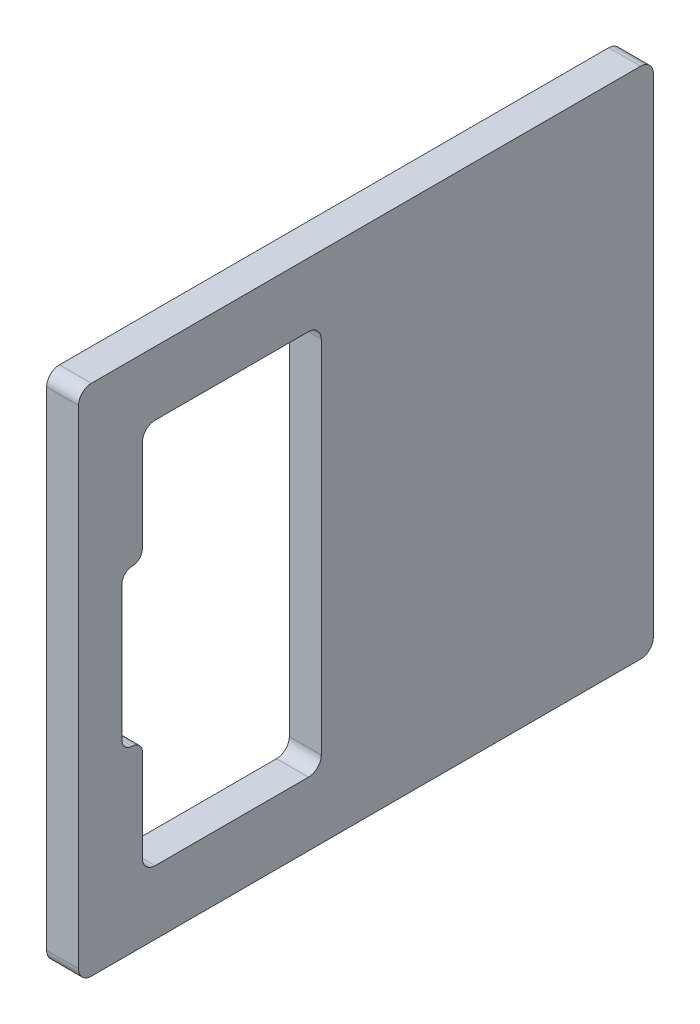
ISO-10303-21;
HEADER;
FILE_DESCRIPTION(('STEP AP214'),'2;1');
FILE_NAME('part.step','',(''),(''),'','','');
FILE_SCHEMA(('AUTOMOTIVE_DESIGN { 1 0 10303 214 1 1 1 1 }'));
ENDSEC;
DATA;
#1=APPLICATION_CONTEXT('core data for automotive mechanical design processes');
#2=APPLICATION_PROTOCOL_DEFINITION('international standard','automotive_design',2000,#1);
#3=PRODUCT_CONTEXT('',#1,'mechanical');
#4=PRODUCT('Part','Part','',(#3));
#5=PRODUCT_RELATED_PRODUCT_CATEGORY('part','',(#4));
#6=PRODUCT_DEFINITION_FORMATION('','',#4);
#7=PRODUCT_DEFINITION_CONTEXT('part definition',#1,'design');
#8=PRODUCT_DEFINITION('design','',#6,#7);
#9=PRODUCT_DEFINITION_SHAPE('','',#8);
#10=(LENGTH_UNIT() NAMED_UNIT(*) SI_UNIT(.MILLI.,.METRE.));
#11=(NAMED_UNIT(*) PLANE_ANGLE_UNIT() SI_UNIT($,.RADIAN.));
#12=(NAMED_UNIT(*) SI_UNIT($,.STERADIAN.) SOLID_ANGLE_UNIT());
#13=UNCERTAINTY_MEASURE_WITH_UNIT(LENGTH_MEASURE(1.E-05),#10,'distance_accuracy_value','');
#14=(GEOMETRIC_REPRESENTATION_CONTEXT(3) GLOBAL_UNCERTAINTY_ASSIGNED_CONTEXT((#13)) GLOBAL_UNIT_ASSIGNED_CONTEXT((#10,
#11,#12)) REPRESENTATION_CONTEXT('',''));
#15=CARTESIAN_POINT('',(0.,0.,0.));
#16=DIRECTION('',(0.,0.,1.));
#17=DIRECTION('',(1.,0.,0.));
#18=AXIS2_PLACEMENT_3D('',#15,#16,#17);
#19=CARTESIAN_POINT('',(1.25,39.2,1.));
#20=DIRECTION('',(1.,0.,0.));
#21=DIRECTION('',(0.,0.,-1.));
#22=AXIS2_PLACEMENT_3D('',#19,#20,#21);
#23=CYLINDRICAL_SURFACE('',#22,1.);
#24=CARTESIAN_POINT('',(0.,39.2,1.));
#25=DIRECTION('',(1.,0.,0.));
#26=DIRECTION('',(0.,0.,-1.));
#27=AXIS2_PLACEMENT_3D('',#24,#25,#26);
#28=CIRCLE('',#27,1.);
#29=CARTESIAN_POINT('',(0.,39.2,0.));
#30=VERTEX_POINT('',#29);
#31=CARTESIAN_POINT('',(0.,40.2,1.));
#32=VERTEX_POINT('',#31);
#33=EDGE_CURVE('E256',#30,#32,#28,.T.);
#34=ORIENTED_EDGE('',*,*,#33,.T.);
#35=DIRECTION('',(1.,0.,0.));
#36=VECTOR('',#35,1.);
#37=CARTESIAN_POINT('',(0.,40.2,1.));
#38=LINE('',#37,#36);
#39=CARTESIAN_POINT('',(2.5,40.2,1.));
#40=VERTEX_POINT('',#39);
#41=EDGE_CURVE('E113',#40,#32,#38,.F.);
#42=ORIENTED_EDGE('',*,*,#41,.F.);
#43=CARTESIAN_POINT('',(2.5,39.2,1.));
#44=DIRECTION('',(1.,0.,0.));
#45=DIRECTION('',(0.,0.,-1.));
#46=AXIS2_PLACEMENT_3D('',#43,#44,#45);
#47=CIRCLE('',#46,1.);
#48=CARTESIAN_POINT('',(2.5,39.2,0.));
#49=VERTEX_POINT('',#48);
#50=EDGE_CURVE('E20',#40,#49,#47,.F.);
#51=ORIENTED_EDGE('',*,*,#50,.T.);
#52=DIRECTION('',(-1.,0.,0.));
#53=VECTOR('',#52,1.);
#54=CARTESIAN_POINT('',(0.,39.2,0.));
#55=LINE('',#54,#53);
#56=EDGE_CURVE('E110',#30,#49,#55,.F.);
#57=ORIENTED_EDGE('',*,*,#56,.F.);
#58=EDGE_LOOP('',(#34,#42,#51,#57));
#59=FACE_BOUND('',#58,.T.);
#60=ADVANCED_FACE('F17',(#59),#23,.T.);
#61=CARTESIAN_POINT('',(1.25,39.2,44.));
#62=DIRECTION('',(1.,0.,0.));
#63=DIRECTION('',(0.,0.,-1.));
#64=AXIS2_PLACEMENT_3D('',#61,#62,#63);
#65=CYLINDRICAL_SURFACE('',#64,1.);
#66=CARTESIAN_POINT('',(0.,39.2,44.));
#67=DIRECTION('',(1.,0.,0.));
#68=DIRECTION('',(0.,0.,-1.));
#69=AXIS2_PLACEMENT_3D('',#66,#67,#68);
#70=CIRCLE('',#69,1.);
#71=CARTESIAN_POINT('',(0.,40.2,44.));
#72=VERTEX_POINT('',#71);
#73=CARTESIAN_POINT('',(0.,39.2,45.));
#74=VERTEX_POINT('',#73);
#75=EDGE_CURVE('E253',#72,#74,#70,.T.);
#76=ORIENTED_EDGE('',*,*,#75,.T.);
#77=DIRECTION('',(1.,0.,0.));
#78=VECTOR('',#77,1.);
#79=CARTESIAN_POINT('',(0.,39.2,45.));
#80=LINE('',#79,#78);
#81=CARTESIAN_POINT('',(2.5,39.2,45.));
#82=VERTEX_POINT('',#81);
#83=EDGE_CURVE('E186',#82,#74,#80,.F.);
#84=ORIENTED_EDGE('',*,*,#83,.F.);
#85=CARTESIAN_POINT('',(2.5,39.2,44.));
#86=DIRECTION('',(1.,0.,0.));
#87=DIRECTION('',(0.,0.,-1.));
#88=AXIS2_PLACEMENT_3D('',#85,#86,#87);
#89=CIRCLE('',#88,1.);
#90=CARTESIAN_POINT('',(2.5,40.2,44.));
#91=VERTEX_POINT('',#90);
#92=EDGE_CURVE('E115',#82,#91,#89,.F.);
#93=ORIENTED_EDGE('',*,*,#92,.T.);
#94=DIRECTION('',(1.,0.,0.));
#95=VECTOR('',#94,1.);
#96=CARTESIAN_POINT('',(0.,40.2,44.));
#97=LINE('',#96,#95);
#98=EDGE_CURVE('E193',#72,#91,#97,.T.);
#99=ORIENTED_EDGE('',*,*,#98,.F.);
#100=EDGE_LOOP('',(#76,#84,#93,#99));
#101=FACE_BOUND('',#100,.T.);
#102=ADVANCED_FACE('F276',(#101),#65,.T.);
#103=CARTESIAN_POINT('',(1.25,1.,44.));
#104=DIRECTION('',(1.,0.,0.));
#105=DIRECTION('',(0.,0.,-1.));
#106=AXIS2_PLACEMENT_3D('',#103,#104,#105);
#107=CYLINDRICAL_SURFACE('',#106,1.);
#108=CARTESIAN_POINT('',(0.,1.,44.));
#109=DIRECTION('',(1.,0.,0.));
#110=DIRECTION('',(0.,0.,-1.));
#111=AXIS2_PLACEMENT_3D('',#108,#109,#110);
#112=CIRCLE('',#111,1.);
#113=CARTESIAN_POINT('',(0.,1.,45.));
#114=VERTEX_POINT('',#113);
#115=CARTESIAN_POINT('',(0.,0.,44.));
#116=VERTEX_POINT('',#115);
#117=EDGE_CURVE('E250',#114,#116,#112,.T.);
#118=ORIENTED_EDGE('',*,*,#117,.T.);
#119=DIRECTION('',(1.,0.,0.));
#120=VECTOR('',#119,1.);
#121=CARTESIAN_POINT('',(0.,0.,44.));
#122=LINE('',#121,#120);
#123=CARTESIAN_POINT('',(2.5,0.,44.));
#124=VERTEX_POINT('',#123);
#125=EDGE_CURVE('E179',#124,#116,#122,.F.);
#126=ORIENTED_EDGE('',*,*,#125,.F.);
#127=CARTESIAN_POINT('',(2.5,1.,44.));
#128=DIRECTION('',(1.,0.,0.));
#129=DIRECTION('',(0.,0.,-1.));
#130=AXIS2_PLACEMENT_3D('',#127,#128,#129);
#131=CIRCLE('',#130,1.);
#132=CARTESIAN_POINT('',(2.5,1.,45.));
#133=VERTEX_POINT('',#132);
#134=EDGE_CURVE('E272',#124,#133,#131,.F.);
#135=ORIENTED_EDGE('',*,*,#134,.T.);
#136=DIRECTION('',(1.,0.,0.));
#137=VECTOR('',#136,1.);
#138=CARTESIAN_POINT('',(0.,1.,45.));
#139=LINE('',#138,#137);
#140=EDGE_CURVE('E183',#114,#133,#139,.T.);
#141=ORIENTED_EDGE('',*,*,#140,.F.);
#142=EDGE_LOOP('',(#118,#126,#135,#141));
#143=FACE_BOUND('',#142,.T.);
#144=ADVANCED_FACE('F357',(#143),#107,.T.);
#145=CARTESIAN_POINT('',(1.25,1.,1.));
#146=DIRECTION('',(1.,0.,0.));
#147=DIRECTION('',(0.,0.,-1.));
#148=AXIS2_PLACEMENT_3D('',#145,#146,#147);
#149=CYLINDRICAL_SURFACE('',#148,1.);
#150=CARTESIAN_POINT('',(0.,1.,1.));
#151=DIRECTION('',(1.,0.,0.));
#152=DIRECTION('',(0.,0.,-1.));
#153=AXIS2_PLACEMENT_3D('',#150,#151,#152);
#154=CIRCLE('',#153,1.);
#155=CARTESIAN_POINT('',(0.,0.,1.));
#156=VERTEX_POINT('',#155);
#157=CARTESIAN_POINT('',(0.,1.,0.));
#158=VERTEX_POINT('',#157);
#159=EDGE_CURVE('E247',#156,#158,#154,.T.);
#160=ORIENTED_EDGE('',*,*,#159,.T.);
#161=DIRECTION('',(-1.,0.,0.));
#162=VECTOR('',#161,1.);
#163=CARTESIAN_POINT('',(0.,1.,0.));
#164=LINE('',#163,#162);
#165=CARTESIAN_POINT('',(2.5,1.,0.));
#166=VERTEX_POINT('',#165);
#167=EDGE_CURVE('E123',#166,#158,#164,.T.);
#168=ORIENTED_EDGE('',*,*,#167,.F.);
#169=CARTESIAN_POINT('',(2.5,1.,1.));
#170=DIRECTION('',(1.,0.,0.));
#171=DIRECTION('',(0.,0.,-1.));
#172=AXIS2_PLACEMENT_3D('',#169,#170,#171);
#173=CIRCLE('',#172,1.);
#174=CARTESIAN_POINT('',(2.5,0.,1.));
#175=VERTEX_POINT('',#174);
#176=EDGE_CURVE('E127',#166,#175,#173,.F.);
#177=ORIENTED_EDGE('',*,*,#176,.T.);
#178=DIRECTION('',(1.,0.,0.));
#179=VECTOR('',#178,1.);
#180=CARTESIAN_POINT('',(0.,0.,1.));
#181=LINE('',#180,#179);
#182=EDGE_CURVE('E176',#156,#175,#181,.T.);
#183=ORIENTED_EDGE('',*,*,#182,.F.);
#184=EDGE_LOOP('',(#160,#168,#177,#183));
#185=FACE_BOUND('',#184,.T.);
#186=ADVANCED_FACE('F364',(#185),#149,.T.);
#187=CARTESIAN_POINT('',(1.25,14.8,40.8));
#188=DIRECTION('',(-1.,0.,0.));
#189=DIRECTION('',(0.,0.,1.));
#190=AXIS2_PLACEMENT_3D('',#187,#188,#189);
#191=CYLINDRICAL_SURFACE('',#190,0.800000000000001);
#192=DIRECTION('',(-1.,0.,0.));
#193=VECTOR('',#192,1.);
#194=CARTESIAN_POINT('',(1.25,14.,40.8));
#195=LINE('',#194,#193);
#196=CARTESIAN_POINT('',(0.,14.,40.8));
#197=VERTEX_POINT('',#196);
#198=CARTESIAN_POINT('',(2.5,14.,40.8));
#199=VERTEX_POINT('',#198);
#200=EDGE_CURVE('E216',#197,#199,#195,.F.);
#201=ORIENTED_EDGE('',*,*,#200,.F.);
#202=CARTESIAN_POINT('',(0.,14.8,40.8));
#203=DIRECTION('',(-1.,0.,0.));
#204=DIRECTION('',(0.,0.,1.));
#205=AXIS2_PLACEMENT_3D('',#202,#203,#204);
#206=CIRCLE('',#205,0.800000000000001);
#207=CARTESIAN_POINT('',(0.,14.8,41.6));
#208=VERTEX_POINT('',#207);
#209=EDGE_CURVE('E215',#197,#208,#206,.T.);
#210=ORIENTED_EDGE('',*,*,#209,.T.);
#211=DIRECTION('',(-1.,0.,0.));
#212=VECTOR('',#211,1.);
#213=CARTESIAN_POINT('',(2.5,14.8,41.6));
#214=LINE('',#213,#212);
#215=CARTESIAN_POINT('',(2.5,14.8,41.6));
#216=VERTEX_POINT('',#215);
#217=EDGE_CURVE('E172',#216,#208,#214,.T.);
#218=ORIENTED_EDGE('',*,*,#217,.F.);
#219=CARTESIAN_POINT('',(2.5,14.8,40.8));
#220=DIRECTION('',(-1.,0.,0.));
#221=DIRECTION('',(0.,0.,1.));
#222=AXIS2_PLACEMENT_3D('',#219,#220,#221);
#223=CIRCLE('',#222,0.800000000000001);
#224=EDGE_CURVE('E269',#199,#216,#223,.T.);
#225=ORIENTED_EDGE('',*,*,#224,.F.);
#226=EDGE_LOOP('',(#201,#210,#218,#225));
#227=FACE_BOUND('',#226,.T.);
#228=ADVANCED_FACE('F333',(#227),#191,.F.);
#229=CARTESIAN_POINT('',(1.25,25.4,40.8));
#230=DIRECTION('',(-1.,0.,0.));
#231=DIRECTION('',(0.,0.,1.));
#232=AXIS2_PLACEMENT_3D('',#229,#230,#231);
#233=CYLINDRICAL_SURFACE('',#232,0.799999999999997);
#234=DIRECTION('',(-1.,0.,0.));
#235=VECTOR('',#234,1.);
#236=CARTESIAN_POINT('',(2.5,25.4,41.6));
#237=LINE('',#236,#235);
#238=CARTESIAN_POINT('',(0.,25.4,41.6));
#239=VERTEX_POINT('',#238);
#240=CARTESIAN_POINT('',(2.5,25.4,41.6));
#241=VERTEX_POINT('',#240);
#242=EDGE_CURVE('E171',#239,#241,#237,.F.);
#243=ORIENTED_EDGE('',*,*,#242,.F.);
#244=CARTESIAN_POINT('',(0.,25.4,40.8));
#245=DIRECTION('',(-1.,0.,0.));
#246=DIRECTION('',(0.,0.,1.));
#247=AXIS2_PLACEMENT_3D('',#244,#245,#246);
#248=CIRCLE('',#247,0.799999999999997);
#249=CARTESIAN_POINT('',(0.,26.2,40.8));
#250=VERTEX_POINT('',#249);
#251=EDGE_CURVE('E244',#239,#250,#248,.T.);
#252=ORIENTED_EDGE('',*,*,#251,.T.);
#253=DIRECTION('',(-1.,0.,0.));
#254=VECTOR('',#253,1.);
#255=CARTESIAN_POINT('',(1.25,26.2,40.8));
#256=LINE('',#255,#254);
#257=CARTESIAN_POINT('',(2.5,26.2,40.8));
#258=VERTEX_POINT('',#257);
#259=EDGE_CURVE('E219',#258,#250,#256,.T.);
#260=ORIENTED_EDGE('',*,*,#259,.F.);
#261=CARTESIAN_POINT('',(2.5,25.4,40.8));
#262=DIRECTION('',(-1.,0.,0.));
#263=DIRECTION('',(0.,0.,1.));
#264=AXIS2_PLACEMENT_3D('',#261,#262,#263);
#265=CIRCLE('',#264,0.799999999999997);
#266=EDGE_CURVE('E267',#241,#258,#265,.T.);
#267=ORIENTED_EDGE('',*,*,#266,.F.);
#268=EDGE_LOOP('',(#243,#252,#260,#267));
#269=FACE_BOUND('',#268,.T.);
#270=ADVANCED_FACE('F372',(#269),#233,.F.);
#271=CARTESIAN_POINT('',(1.25,27.,40.8));
#272=DIRECTION('',(-1.,0.,0.));
#273=DIRECTION('',(0.,0.,1.));
#274=AXIS2_PLACEMENT_3D('',#271,#272,#273);
#275=CYLINDRICAL_SURFACE('',#274,0.800000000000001);
#276=CARTESIAN_POINT('',(2.5,27.,40.8));
#277=DIRECTION('',(-1.,0.,0.));
#278=DIRECTION('',(0.,0.,1.));
#279=AXIS2_PLACEMENT_3D('',#276,#277,#278);
#280=CIRCLE('',#279,0.800000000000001);
#281=CARTESIAN_POINT('',(2.5,27.,40.));
#282=VERTEX_POINT('',#281);
#283=EDGE_CURVE('E223',#282,#258,#280,.T.);
#284=ORIENTED_EDGE('',*,*,#283,.T.);
#285=ORIENTED_EDGE('',*,*,#259,.T.);
#286=CARTESIAN_POINT('',(0.,27.,40.8));
#287=DIRECTION('',(-1.,0.,0.));
#288=DIRECTION('',(0.,0.,1.));
#289=AXIS2_PLACEMENT_3D('',#286,#287,#288);
#290=CIRCLE('',#289,0.800000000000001);
#291=CARTESIAN_POINT('',(0.,27.,40.));
#292=VERTEX_POINT('',#291);
#293=EDGE_CURVE('E241',#250,#292,#290,.F.);
#294=ORIENTED_EDGE('',*,*,#293,.T.);
#295=DIRECTION('',(1.,0.,0.));
#296=VECTOR('',#295,1.);
#297=CARTESIAN_POINT('',(0.,27.,40.));
#298=LINE('',#297,#296);
#299=EDGE_CURVE('E162',#292,#282,#298,.T.);
#300=ORIENTED_EDGE('',*,*,#299,.T.);
#301=EDGE_LOOP('',(#284,#285,#294,#300));
#302=FACE_BOUND('',#301,.T.);
#303=ADVANCED_FACE('F430',(#302),#275,.T.);
#304=CARTESIAN_POINT('',(1.25,34.2,39.));
#305=DIRECTION('',(1.,0.,0.));
#306=DIRECTION('',(0.,0.,-1.));
#307=AXIS2_PLACEMENT_3D('',#304,#305,#306);
#308=CYLINDRICAL_SURFACE('',#307,1.);
#309=DIRECTION('',(1.,0.,0.));
#310=VECTOR('',#309,1.);
#311=CARTESIAN_POINT('',(0.,35.2,39.));
#312=LINE('',#311,#310);
#313=CARTESIAN_POINT('',(0.,35.2,39.));
#314=VERTEX_POINT('',#313);
#315=CARTESIAN_POINT('',(2.5,35.2,39.));
#316=VERTEX_POINT('',#315);
#317=EDGE_CURVE('E158',#314,#316,#312,.T.);
#318=ORIENTED_EDGE('',*,*,#317,.T.);
#319=CARTESIAN_POINT('',(2.5,34.2,39.));
#320=DIRECTION('',(1.,0.,0.));
#321=DIRECTION('',(0.,0.,-1.));
#322=AXIS2_PLACEMENT_3D('',#319,#320,#321);
#323=CIRCLE('',#322,1.);
#324=CARTESIAN_POINT('',(2.5,34.2,40.));
#325=VERTEX_POINT('',#324);
#326=EDGE_CURVE('E222',#325,#316,#323,.F.);
#327=ORIENTED_EDGE('',*,*,#326,.F.);
#328=DIRECTION('',(1.,0.,0.));
#329=VECTOR('',#328,1.);
#330=CARTESIAN_POINT('',(0.,34.2,40.));
#331=LINE('',#330,#329);
#332=CARTESIAN_POINT('',(0.,34.2,40.));
#333=VERTEX_POINT('',#332);
#334=EDGE_CURVE('E168',#325,#333,#331,.F.);
#335=ORIENTED_EDGE('',*,*,#334,.T.);
#336=CARTESIAN_POINT('',(0.,34.2,39.));
#337=DIRECTION('',(1.,0.,0.));
#338=DIRECTION('',(0.,0.,-1.));
#339=AXIS2_PLACEMENT_3D('',#336,#337,#338);
#340=CIRCLE('',#339,1.);
#341=EDGE_CURVE('E238',#333,#314,#340,.F.);
#342=ORIENTED_EDGE('',*,*,#341,.T.);
#343=EDGE_LOOP('',(#318,#327,#335,#342));
#344=FACE_BOUND('',#343,.T.);
#345=ADVANCED_FACE('F426',(#344),#308,.F.);
#346=CARTESIAN_POINT('',(1.25,34.2,27.));
#347=DIRECTION('',(1.,0.,0.));
#348=DIRECTION('',(0.,0.,-1.));
#349=AXIS2_PLACEMENT_3D('',#346,#347,#348);
#350=CYLINDRICAL_SURFACE('',#349,1.);
#351=DIRECTION('',(-1.,0.,0.));
#352=VECTOR('',#351,1.);
#353=CARTESIAN_POINT('',(0.,34.2,26.));
#354=LINE('',#353,#352);
#355=CARTESIAN_POINT('',(0.,34.2,26.));
#356=VERTEX_POINT('',#355);
#357=CARTESIAN_POINT('',(2.5,34.2,26.));
#358=VERTEX_POINT('',#357);
#359=EDGE_CURVE('E151',#356,#358,#354,.F.);
#360=ORIENTED_EDGE('',*,*,#359,.T.);
#361=CARTESIAN_POINT('',(2.5,34.2,27.));
#362=DIRECTION('',(1.,0.,0.));
#363=DIRECTION('',(0.,0.,-1.));
#364=AXIS2_PLACEMENT_3D('',#361,#362,#363);
#365=CIRCLE('',#364,1.);
#366=CARTESIAN_POINT('',(2.5,35.2,27.));
#367=VERTEX_POINT('',#366);
#368=EDGE_CURVE('E262',#367,#358,#365,.F.);
#369=ORIENTED_EDGE('',*,*,#368,.F.);
#370=DIRECTION('',(1.,0.,0.));
#371=VECTOR('',#370,1.);
#372=CARTESIAN_POINT('',(0.,35.2,27.));
#373=LINE('',#372,#371);
#374=CARTESIAN_POINT('',(0.,35.2,27.));
#375=VERTEX_POINT('',#374);
#376=EDGE_CURVE('E161',#367,#375,#373,.F.);
#377=ORIENTED_EDGE('',*,*,#376,.T.);
#378=CARTESIAN_POINT('',(0.,34.2,27.));
#379=DIRECTION('',(1.,0.,0.));
#380=DIRECTION('',(0.,0.,-1.));
#381=AXIS2_PLACEMENT_3D('',#378,#379,#380);
#382=CIRCLE('',#381,1.);
#383=EDGE_CURVE('E235',#375,#356,#382,.F.);
#384=ORIENTED_EDGE('',*,*,#383,.T.);
#385=EDGE_LOOP('',(#360,#369,#377,#384));
#386=FACE_BOUND('',#385,.T.);
#387=ADVANCED_FACE('F422',(#386),#350,.F.);
#388=CARTESIAN_POINT('',(1.25,6.,27.));
#389=DIRECTION('',(1.,0.,0.));
#390=DIRECTION('',(0.,0.,-1.));
#391=AXIS2_PLACEMENT_3D('',#388,#389,#390);
#392=CYLINDRICAL_SURFACE('',#391,1.);
#393=DIRECTION('',(1.,0.,0.));
#394=VECTOR('',#393,1.);
#395=CARTESIAN_POINT('',(0.,5.,27.));
#396=LINE('',#395,#394);
#397=CARTESIAN_POINT('',(0.,5.,27.));
#398=VERTEX_POINT('',#397);
#399=CARTESIAN_POINT('',(2.5,5.,27.));
#400=VERTEX_POINT('',#399);
#401=EDGE_CURVE('E142',#398,#400,#396,.T.);
#402=ORIENTED_EDGE('',*,*,#401,.T.);
#403=CARTESIAN_POINT('',(2.5,6.,27.));
#404=DIRECTION('',(1.,0.,0.));
#405=DIRECTION('',(0.,0.,-1.));
#406=AXIS2_PLACEMENT_3D('',#403,#404,#405);
#407=CIRCLE('',#406,1.);
#408=CARTESIAN_POINT('',(2.5,6.00000000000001,26.));
#409=VERTEX_POINT('',#408);
#410=EDGE_CURVE('E260',#409,#400,#407,.F.);
#411=ORIENTED_EDGE('',*,*,#410,.F.);
#412=DIRECTION('',(-1.,0.,0.));
#413=VECTOR('',#412,1.);
#414=CARTESIAN_POINT('',(0.,6.00000000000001,26.));
#415=LINE('',#414,#413);
#416=CARTESIAN_POINT('',(0.,6.00000000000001,26.));
#417=VERTEX_POINT('',#416);
#418=EDGE_CURVE('E154',#409,#417,#415,.T.);
#419=ORIENTED_EDGE('',*,*,#418,.T.);
#420=CARTESIAN_POINT('',(0.,6.,27.));
#421=DIRECTION('',(1.,0.,0.));
#422=DIRECTION('',(0.,0.,-1.));
#423=AXIS2_PLACEMENT_3D('',#420,#421,#422);
#424=CIRCLE('',#423,1.);
#425=EDGE_CURVE('E232',#417,#398,#424,.F.);
#426=ORIENTED_EDGE('',*,*,#425,.T.);
#427=EDGE_LOOP('',(#402,#411,#419,#426));
#428=FACE_BOUND('',#427,.T.);
#429=ADVANCED_FACE('F418',(#428),#392,.F.);
#430=CARTESIAN_POINT('',(1.25,6.,39.));
#431=DIRECTION('',(1.,0.,0.));
#432=DIRECTION('',(0.,0.,-1.));
#433=AXIS2_PLACEMENT_3D('',#430,#431,#432);
#434=CYLINDRICAL_SURFACE('',#433,1.);
#435=DIRECTION('',(1.,0.,0.));
#436=VECTOR('',#435,1.);
#437=CARTESIAN_POINT('',(0.,6.,40.));
#438=LINE('',#437,#436);
#439=CARTESIAN_POINT('',(0.,6.,40.));
#440=VERTEX_POINT('',#439);
#441=CARTESIAN_POINT('',(2.5,6.,40.));
#442=VERTEX_POINT('',#441);
#443=EDGE_CURVE('E139',#440,#442,#438,.T.);
#444=ORIENTED_EDGE('',*,*,#443,.T.);
#445=CARTESIAN_POINT('',(2.5,6.,39.));
#446=DIRECTION('',(1.,0.,0.));
#447=DIRECTION('',(0.,0.,-1.));
#448=AXIS2_PLACEMENT_3D('',#445,#446,#447);
#449=CIRCLE('',#448,1.);
#450=CARTESIAN_POINT('',(2.5,5.,39.));
#451=VERTEX_POINT('',#450);
#452=EDGE_CURVE('E218',#451,#442,#449,.F.);
#453=ORIENTED_EDGE('',*,*,#452,.F.);
#454=DIRECTION('',(1.,0.,0.));
#455=VECTOR('',#454,1.);
#456=CARTESIAN_POINT('',(0.,5.,39.));
#457=LINE('',#456,#455);
#458=CARTESIAN_POINT('',(0.,5.,39.));
#459=VERTEX_POINT('',#458);
#460=EDGE_CURVE('E147',#451,#459,#457,.F.);
#461=ORIENTED_EDGE('',*,*,#460,.T.);
#462=CARTESIAN_POINT('',(0.,6.,39.));
#463=DIRECTION('',(1.,0.,0.));
#464=DIRECTION('',(0.,0.,-1.));
#465=AXIS2_PLACEMENT_3D('',#462,#463,#464);
#466=CIRCLE('',#465,1.);
#467=EDGE_CURVE('E229',#459,#440,#466,.F.);
#468=ORIENTED_EDGE('',*,*,#467,.T.);
#469=EDGE_LOOP('',(#444,#453,#461,#468));
#470=FACE_BOUND('',#469,.T.);
#471=ADVANCED_FACE('F415',(#470),#434,.F.);
#472=CARTESIAN_POINT('',(1.25,13.2,40.8));
#473=DIRECTION('',(-1.,0.,0.));
#474=DIRECTION('',(0.,0.,1.));
#475=AXIS2_PLACEMENT_3D('',#472,#473,#474);
#476=CYLINDRICAL_SURFACE('',#475,0.799999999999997);
#477=CARTESIAN_POINT('',(2.5,13.2,40.8));
#478=DIRECTION('',(-1.,0.,0.));
#479=DIRECTION('',(0.,0.,1.));
#480=AXIS2_PLACEMENT_3D('',#477,#478,#479);
#481=CIRCLE('',#480,0.799999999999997);
#482=CARTESIAN_POINT('',(2.5,13.2,40.));
#483=VERTEX_POINT('',#482);
#484=EDGE_CURVE('E35',#199,#483,#481,.T.);
#485=ORIENTED_EDGE('',*,*,#484,.T.);
#486=DIRECTION('',(1.,0.,0.));
#487=VECTOR('',#486,1.);
#488=CARTESIAN_POINT('',(0.,13.2,40.));
#489=LINE('',#488,#487);
#490=CARTESIAN_POINT('',(0.,13.2,40.));
#491=VERTEX_POINT('',#490);
#492=EDGE_CURVE('E135',#483,#491,#489,.F.);
#493=ORIENTED_EDGE('',*,*,#492,.T.);
#494=CARTESIAN_POINT('',(0.,13.2,40.8));
#495=DIRECTION('',(-1.,0.,0.));
#496=DIRECTION('',(0.,0.,1.));
#497=AXIS2_PLACEMENT_3D('',#494,#495,#496);
#498=CIRCLE('',#497,0.799999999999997);
#499=EDGE_CURVE('E226',#491,#197,#498,.F.);
#500=ORIENTED_EDGE('',*,*,#499,.T.);
#501=ORIENTED_EDGE('',*,*,#200,.T.);
#502=EDGE_LOOP('',(#485,#493,#500,#501));
#503=FACE_BOUND('',#502,.T.);
#504=ADVANCED_FACE('F412',(#503),#476,.T.);
#505=CARTESIAN_POINT('',(0.,0.,0.));
#506=DIRECTION('',(1.,0.,0.));
#507=DIRECTION('',(0.,0.,-1.));
#508=AXIS2_PLACEMENT_3D('',#505,#506,#507);
#509=PLANE('',#508);
#510=ORIENTED_EDGE('',*,*,#499,.F.);
#511=DIRECTION('',(0.,1.,0.));
#512=VECTOR('',#511,1.);
#513=CARTESIAN_POINT('',(0.,35.2,40.));
#514=LINE('',#513,#512);
#515=EDGE_CURVE('E130',#491,#440,#514,.F.);
#516=ORIENTED_EDGE('',*,*,#515,.T.);
#517=ORIENTED_EDGE('',*,*,#467,.F.);
#518=DIRECTION('',(0.,0.,-1.));
#519=VECTOR('',#518,1.);
#520=CARTESIAN_POINT('',(0.,5.,40.));
#521=LINE('',#520,#519);
#522=EDGE_CURVE('E146',#459,#398,#521,.T.);
#523=ORIENTED_EDGE('',*,*,#522,.T.);
#524=ORIENTED_EDGE('',*,*,#425,.F.);
#525=DIRECTION('',(0.,1.,0.));
#526=VECTOR('',#525,1.);
#527=CARTESIAN_POINT('',(0.,5.,26.));
#528=LINE('',#527,#526);
#529=EDGE_CURVE('E150',#417,#356,#528,.T.);
#530=ORIENTED_EDGE('',*,*,#529,.T.);
#531=ORIENTED_EDGE('',*,*,#383,.F.);
#532=DIRECTION('',(0.,0.,1.));
#533=VECTOR('',#532,1.);
#534=CARTESIAN_POINT('',(0.,35.2,26.));
#535=LINE('',#534,#533);
#536=EDGE_CURVE('E155',#375,#314,#535,.T.);
#537=ORIENTED_EDGE('',*,*,#536,.T.);
#538=ORIENTED_EDGE('',*,*,#341,.F.);
#539=DIRECTION('',(0.,1.,0.));
#540=VECTOR('',#539,1.);
#541=CARTESIAN_POINT('',(0.,35.2,40.));
#542=LINE('',#541,#540);
#543=EDGE_CURVE('E167',#333,#292,#542,.F.);
#544=ORIENTED_EDGE('',*,*,#543,.T.);
#545=ORIENTED_EDGE('',*,*,#293,.F.);
#546=ORIENTED_EDGE('',*,*,#251,.F.);
#547=DIRECTION('',(0.,1.,0.));
#548=VECTOR('',#547,1.);
#549=CARTESIAN_POINT('',(0.,26.2,41.6));
#550=LINE('',#549,#548);
#551=EDGE_CURVE('E175',#208,#239,#550,.T.);
#552=ORIENTED_EDGE('',*,*,#551,.F.);
#553=ORIENTED_EDGE('',*,*,#209,.F.);
#554=EDGE_LOOP('',(#510,#516,#517,#523,#524,#530,#531,#537,#538,#544,#545,#546,#552,#553));
#555=FACE_BOUND('',#554,.T.);
#556=ORIENTED_EDGE('',*,*,#159,.F.);
#557=DIRECTION('',(0.,0.,-1.));
#558=VECTOR('',#557,1.);
#559=CARTESIAN_POINT('',(0.,0.,45.));
#560=LINE('',#559,#558);
#561=EDGE_CURVE('E182',#116,#156,#560,.T.);
#562=ORIENTED_EDGE('',*,*,#561,.F.);
#563=ORIENTED_EDGE('',*,*,#117,.F.);
#564=DIRECTION('',(0.,1.,0.));
#565=VECTOR('',#564,1.);
#566=CARTESIAN_POINT('',(0.,40.2,45.));
#567=LINE('',#566,#565);
#568=EDGE_CURVE('E189',#74,#114,#567,.F.);
#569=ORIENTED_EDGE('',*,*,#568,.F.);
#570=ORIENTED_EDGE('',*,*,#75,.F.);
#571=DIRECTION('',(0.,0.,1.));
#572=VECTOR('',#571,1.);
#573=CARTESIAN_POINT('',(0.,40.2,0.));
#574=LINE('',#573,#572);
#575=EDGE_CURVE('E196',#32,#72,#574,.T.);
#576=ORIENTED_EDGE('',*,*,#575,.F.);
#577=ORIENTED_EDGE('',*,*,#33,.F.);
#578=DIRECTION('',(0.,1.,0.));
#579=VECTOR('',#578,1.);
#580=CARTESIAN_POINT('',(0.,0.,0.));
#581=LINE('',#580,#579);
#582=EDGE_CURVE('E122',#158,#30,#581,.T.);
#583=ORIENTED_EDGE('',*,*,#582,.F.);
#584=EDGE_LOOP('',(#556,#562,#563,#569,#570,#576,#577,#583));
#585=FACE_BOUND('',#584,.T.);
#586=ADVANCED_FACE('F289',(#555,#585),#509,.F.);
#587=CARTESIAN_POINT('',(0.,0.,0.));
#588=DIRECTION('',(0.,0.,-1.));
#589=DIRECTION('',(-1.,0.,0.));
#590=AXIS2_PLACEMENT_3D('',#587,#588,#589);
#591=PLANE('',#590);
#592=DIRECTION('',(0.,1.,0.));
#593=VECTOR('',#592,1.);
#594=CARTESIAN_POINT('',(2.5,0.,0.));
#595=LINE('',#594,#593);
#596=EDGE_CURVE('E120',#166,#49,#595,.T.);
#597=ORIENTED_EDGE('',*,*,#596,.F.);
#598=ORIENTED_EDGE('',*,*,#167,.T.);
#599=ORIENTED_EDGE('',*,*,#582,.T.);
#600=ORIENTED_EDGE('',*,*,#56,.T.);
#601=EDGE_LOOP('',(#597,#598,#599,#600));
#602=FACE_BOUND('',#601,.T.);
#603=ADVANCED_FACE('F118',(#602),#591,.T.);
#604=CARTESIAN_POINT('',(0.,40.2,0.));
#605=DIRECTION('',(0.,1.,0.));
#606=DIRECTION('',(0.,0.,1.));
#607=AXIS2_PLACEMENT_3D('',#604,#605,#606);
#608=PLANE('',#607);
#609=DIRECTION('',(0.,0.,-1.));
#610=VECTOR('',#609,1.);
#611=CARTESIAN_POINT('',(2.5,40.2,0.));
#612=LINE('',#611,#610);
#613=EDGE_CURVE('E129',#40,#91,#612,.F.);
#614=ORIENTED_EDGE('',*,*,#613,.F.);
#615=ORIENTED_EDGE('',*,*,#41,.T.);
#616=ORIENTED_EDGE('',*,*,#575,.T.);
#617=ORIENTED_EDGE('',*,*,#98,.T.);
#618=EDGE_LOOP('',(#614,#615,#616,#617));
#619=FACE_BOUND('',#618,.T.);
#620=ADVANCED_FACE('F281',(#619),#608,.T.);
#621=CARTESIAN_POINT('',(0.,40.2,45.));
#622=DIRECTION('',(0.,0.,1.));
#623=DIRECTION('',(1.,0.,0.));
#624=AXIS2_PLACEMENT_3D('',#621,#622,#623);
#625=PLANE('',#624);
#626=ORIENTED_EDGE('',*,*,#568,.T.);
#627=ORIENTED_EDGE('',*,*,#140,.T.);
#628=DIRECTION('',(0.,1.,0.));
#629=VECTOR('',#628,1.);
#630=CARTESIAN_POINT('',(2.5,0.,45.));
#631=LINE('',#630,#629);
#632=EDGE_CURVE('E132',#82,#133,#631,.F.);
#633=ORIENTED_EDGE('',*,*,#632,.F.);
#634=ORIENTED_EDGE('',*,*,#83,.T.);
#635=EDGE_LOOP('',(#626,#627,#633,#634));
#636=FACE_BOUND('',#635,.T.);
#637=ADVANCED_FACE('F354',(#636),#625,.T.);
#638=CARTESIAN_POINT('',(0.,0.,45.));
#639=DIRECTION('',(0.,-1.,0.));
#640=DIRECTION('',(0.,0.,-1.));
#641=AXIS2_PLACEMENT_3D('',#638,#639,#640);
#642=PLANE('',#641);
#643=ORIENTED_EDGE('',*,*,#561,.T.);
#644=ORIENTED_EDGE('',*,*,#182,.T.);
#645=DIRECTION('',(0.,0.,-1.));
#646=VECTOR('',#645,1.);
#647=CARTESIAN_POINT('',(2.5,0.,0.));
#648=LINE('',#647,#646);
#649=EDGE_CURVE('E345',#124,#175,#648,.T.);
#650=ORIENTED_EDGE('',*,*,#649,.F.);
#651=ORIENTED_EDGE('',*,*,#125,.T.);
#652=EDGE_LOOP('',(#643,#644,#650,#651));
#653=FACE_BOUND('',#652,.T.);
#654=ADVANCED_FACE('F361',(#653),#642,.T.);
#655=CARTESIAN_POINT('',(2.5,26.2,41.6));
#656=DIRECTION('',(0.,0.,-1.));
#657=DIRECTION('',(-1.,0.,0.));
#658=AXIS2_PLACEMENT_3D('',#655,#656,#657);
#659=PLANE('',#658);
#660=ORIENTED_EDGE('',*,*,#551,.T.);
#661=ORIENTED_EDGE('',*,*,#242,.T.);
#662=DIRECTION('',(0.,1.,0.));
#663=VECTOR('',#662,1.);
#664=CARTESIAN_POINT('',(2.5,0.,41.6));
#665=LINE('',#664,#663);
#666=EDGE_CURVE('E342',#216,#241,#665,.T.);
#667=ORIENTED_EDGE('',*,*,#666,.F.);
#668=ORIENTED_EDGE('',*,*,#217,.T.);
#669=EDGE_LOOP('',(#660,#661,#667,#668));
#670=FACE_BOUND('',#669,.T.);
#671=ADVANCED_FACE('F340',(#670),#659,.T.);
#672=CARTESIAN_POINT('',(0.,35.2,40.));
#673=DIRECTION('',(0.,0.,1.));
#674=DIRECTION('',(1.,0.,0.));
#675=AXIS2_PLACEMENT_3D('',#672,#673,#674);
#676=PLANE('',#675);
#677=ORIENTED_EDGE('',*,*,#299,.F.);
#678=ORIENTED_EDGE('',*,*,#543,.F.);
#679=ORIENTED_EDGE('',*,*,#334,.F.);
#680=DIRECTION('',(0.,1.,0.));
#681=VECTOR('',#680,1.);
#682=CARTESIAN_POINT('',(2.5,0.,40.));
#683=LINE('',#682,#681);
#684=EDGE_CURVE('E344',#282,#325,#683,.T.);
#685=ORIENTED_EDGE('',*,*,#684,.F.);
#686=EDGE_LOOP('',(#677,#678,#679,#685));
#687=FACE_BOUND('',#686,.T.);
#688=ADVANCED_FACE('F395',(#687),#676,.F.);
#689=CARTESIAN_POINT('',(0.,35.2,26.));
#690=DIRECTION('',(0.,1.,0.));
#691=DIRECTION('',(0.,0.,1.));
#692=AXIS2_PLACEMENT_3D('',#689,#690,#691);
#693=PLANE('',#692);
#694=ORIENTED_EDGE('',*,*,#376,.F.);
#695=DIRECTION('',(0.,0.,-1.));
#696=VECTOR('',#695,1.);
#697=CARTESIAN_POINT('',(2.5,35.2,0.));
#698=LINE('',#697,#696);
#699=EDGE_CURVE('E348',#316,#367,#698,.T.);
#700=ORIENTED_EDGE('',*,*,#699,.F.);
#701=ORIENTED_EDGE('',*,*,#317,.F.);
#702=ORIENTED_EDGE('',*,*,#536,.F.);
#703=EDGE_LOOP('',(#694,#700,#701,#702));
#704=FACE_BOUND('',#703,.T.);
#705=ADVANCED_FACE('F391',(#704),#693,.F.);
#706=CARTESIAN_POINT('',(0.,5.,26.));
#707=DIRECTION('',(0.,0.,-1.));
#708=DIRECTION('',(-1.,0.,0.));
#709=AXIS2_PLACEMENT_3D('',#706,#707,#708);
#710=PLANE('',#709);
#711=ORIENTED_EDGE('',*,*,#418,.F.);
#712=DIRECTION('',(0.,1.,0.));
#713=VECTOR('',#712,1.);
#714=CARTESIAN_POINT('',(2.5,0.,26.));
#715=LINE('',#714,#713);
#716=EDGE_CURVE('E451',#358,#409,#715,.F.);
#717=ORIENTED_EDGE('',*,*,#716,.F.);
#718=ORIENTED_EDGE('',*,*,#359,.F.);
#719=ORIENTED_EDGE('',*,*,#529,.F.);
#720=EDGE_LOOP('',(#711,#717,#718,#719));
#721=FACE_BOUND('',#720,.T.);
#722=ADVANCED_FACE('F387',(#721),#710,.F.);
#723=CARTESIAN_POINT('',(0.,5.,40.));
#724=DIRECTION('',(0.,-1.,0.));
#725=DIRECTION('',(0.,0.,-1.));
#726=AXIS2_PLACEMENT_3D('',#723,#724,#725);
#727=PLANE('',#726);
#728=ORIENTED_EDGE('',*,*,#401,.F.);
#729=ORIENTED_EDGE('',*,*,#522,.F.);
#730=ORIENTED_EDGE('',*,*,#460,.F.);
#731=DIRECTION('',(0.,0.,-1.));
#732=VECTOR('',#731,1.);
#733=CARTESIAN_POINT('',(2.5,5.,0.));
#734=LINE('',#733,#732);
#735=EDGE_CURVE('E26',#400,#451,#734,.F.);
#736=ORIENTED_EDGE('',*,*,#735,.F.);
#737=EDGE_LOOP('',(#728,#729,#730,#736));
#738=FACE_BOUND('',#737,.T.);
#739=ADVANCED_FACE('F381',(#738),#727,.F.);
#740=CARTESIAN_POINT('',(0.,35.2,40.));
#741=DIRECTION('',(0.,0.,1.));
#742=DIRECTION('',(1.,0.,0.));
#743=AXIS2_PLACEMENT_3D('',#740,#741,#742);
#744=PLANE('',#743);
#745=ORIENTED_EDGE('',*,*,#492,.F.);
#746=DIRECTION('',(0.,1.,0.));
#747=VECTOR('',#746,1.);
#748=CARTESIAN_POINT('',(2.5,0.,40.));
#749=LINE('',#748,#747);
#750=EDGE_CURVE('E11',#442,#483,#749,.T.);
#751=ORIENTED_EDGE('',*,*,#750,.F.);
#752=ORIENTED_EDGE('',*,*,#443,.F.);
#753=ORIENTED_EDGE('',*,*,#515,.F.);
#754=EDGE_LOOP('',(#745,#751,#752,#753));
#755=FACE_BOUND('',#754,.T.);
#756=ADVANCED_FACE('F376',(#755),#744,.F.);
#757=CARTESIAN_POINT('',(2.5,0.,0.));
#758=DIRECTION('',(1.,0.,0.));
#759=DIRECTION('',(0.,0.,-1.));
#760=AXIS2_PLACEMENT_3D('',#757,#758,#759);
#761=PLANE('',#760);
#762=ORIENTED_EDGE('',*,*,#750,.T.);
#763=ORIENTED_EDGE('',*,*,#484,.F.);
#764=ORIENTED_EDGE('',*,*,#224,.T.);
#765=ORIENTED_EDGE('',*,*,#666,.T.);
#766=ORIENTED_EDGE('',*,*,#266,.T.);
#767=ORIENTED_EDGE('',*,*,#283,.F.);
#768=ORIENTED_EDGE('',*,*,#684,.T.);
#769=ORIENTED_EDGE('',*,*,#326,.T.);
#770=ORIENTED_EDGE('',*,*,#699,.T.);
#771=ORIENTED_EDGE('',*,*,#368,.T.);
#772=ORIENTED_EDGE('',*,*,#716,.T.);
#773=ORIENTED_EDGE('',*,*,#410,.T.);
#774=ORIENTED_EDGE('',*,*,#735,.T.);
#775=ORIENTED_EDGE('',*,*,#452,.T.);
#776=EDGE_LOOP('',(#762,#763,#764,#765,#766,#767,#768,#769,#770,#771,#772,#773,#774,#775));
#777=FACE_BOUND('',#776,.T.);
#778=ORIENTED_EDGE('',*,*,#649,.T.);
#779=ORIENTED_EDGE('',*,*,#176,.F.);
#780=ORIENTED_EDGE('',*,*,#596,.T.);
#781=ORIENTED_EDGE('',*,*,#50,.F.);
#782=ORIENTED_EDGE('',*,*,#613,.T.);
#783=ORIENTED_EDGE('',*,*,#92,.F.);
#784=ORIENTED_EDGE('',*,*,#632,.T.);
#785=ORIENTED_EDGE('',*,*,#134,.F.);
#786=EDGE_LOOP('',(#778,#779,#780,#781,#782,#783,#784,#785));
#787=FACE_BOUND('',#786,.T.);
#788=ADVANCED_FACE('F126',(#777,#787),#761,.T.);
#789=CLOSED_SHELL('',(#60,#102,#144,#186,#228,#270,#303,#345,#387,#429,#471,#504,#586,#603,#620,
#637,#654,#671,#688,#705,#722,#739,#756,#788));
#790=MANIFOLD_SOLID_BREP('B1',#789);
#791=ADVANCED_BREP_SHAPE_REPRESENTATION('',(#18,#790),#14);
#792=SHAPE_DEFINITION_REPRESENTATION(#9,#791);
ENDSEC;
END-ISO-10303-21;
